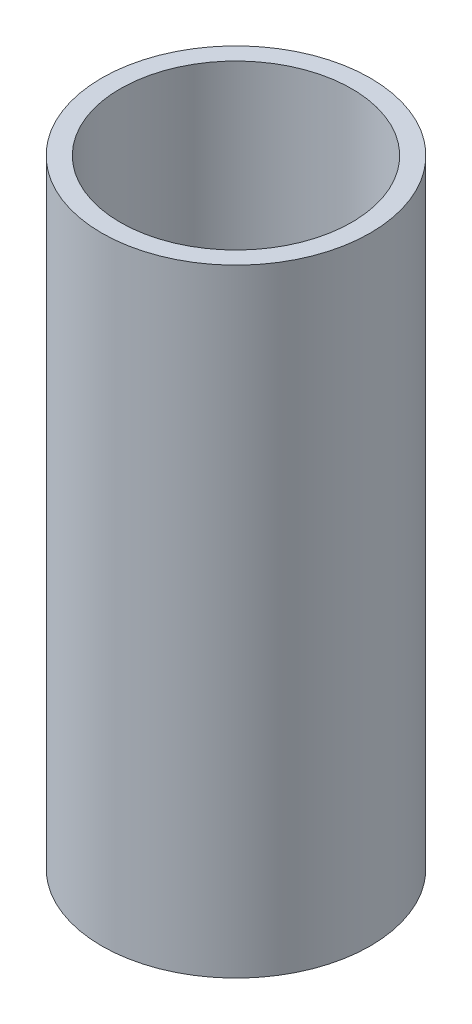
from build123d import *

# Parameters (mm, degrees)
SKETCH1_R           = 22.098
SKETCH1_R_2         = 19.05
BOSS_EXTRUDE1_DEPTH = 50.8


with BuildPart() as part:
    # Sketch1 → Boss-Extrude1 (new, symmetric)
    with BuildSketch(Plane(origin=(0, 0, 0), x_dir=(1, 0, 0), z_dir=(0, 1, 0))):
        with Locations(Location((0, 0, 0), (0, 0, 270))):
            Circle(SKETCH1_R)
        with Locations(Location((0, 0, 0), (0, 0, 270))):
            Circle(SKETCH1_R_2, mode=Mode.SUBTRACT)
    extrude(amount=BOSS_EXTRUDE1_DEPTH, both=True)


solid = part.part
